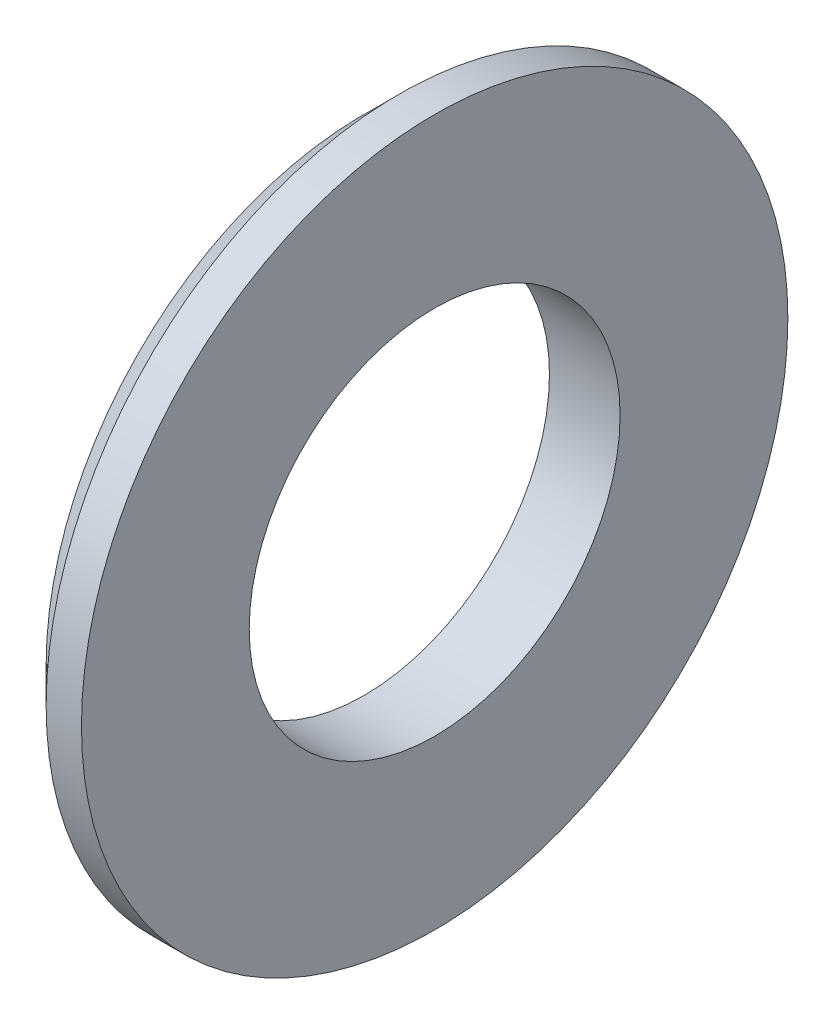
from build123d import *


with BuildPart() as part:
    # Sketch1 → Base-Revolve (revolve)
    with BuildSketch(Plane.XY, mode=Mode.PRIVATE) as base_revolve_sk:
        Polygon((0, 5.25), (0, 10), (-1, 10), (-2, 9), (-2, 5.25), align=None)
    revolve(base_revolve_sk.sketch.rotate(Axis((-34.925, 0, 0), (1, 0, 0)), 90), axis=Axis((-34.925, 0, 0), (1, 0, 0)))


solid = part.part
